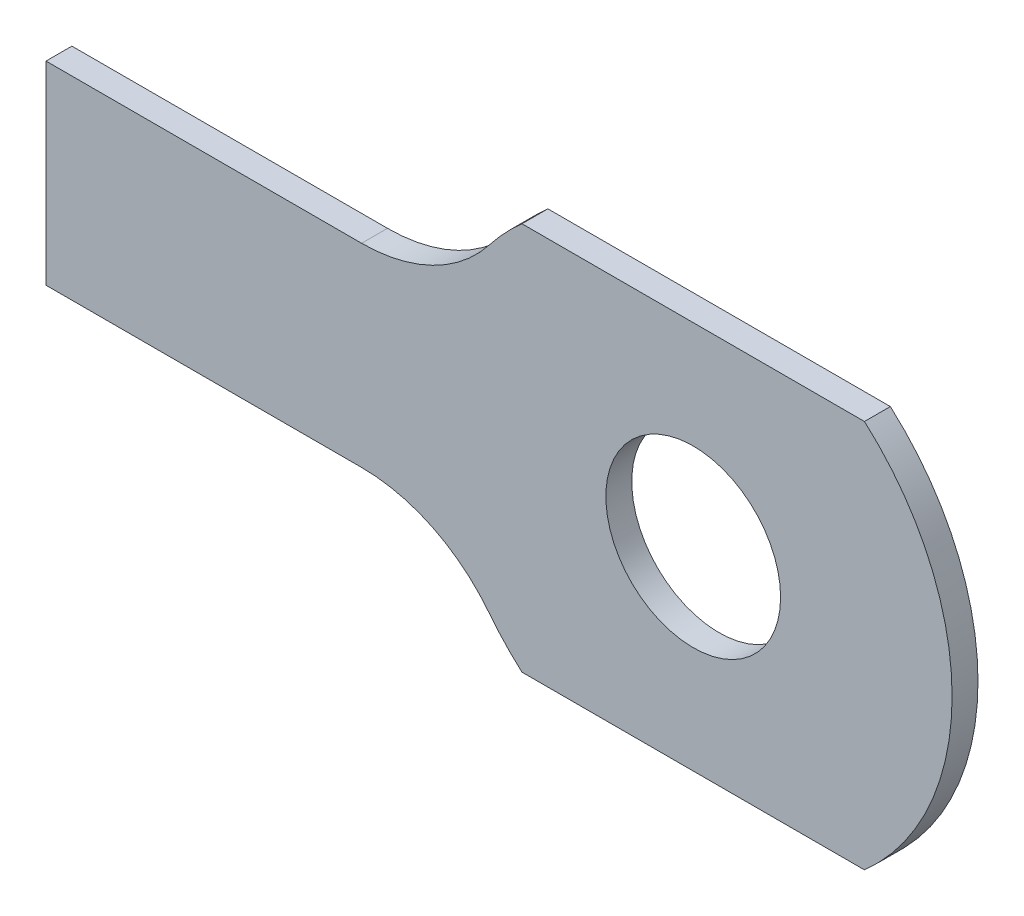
ISO-10303-21;
HEADER;
FILE_DESCRIPTION(('STEP AP214'),'2;1');
FILE_NAME('part.step','',(''),(''),'','','');
FILE_SCHEMA(('AUTOMOTIVE_DESIGN { 1 0 10303 214 1 1 1 1 }'));
ENDSEC;
DATA;
#1=APPLICATION_CONTEXT('core data for automotive mechanical design processes');
#2=APPLICATION_PROTOCOL_DEFINITION('international standard','automotive_design',2000,#1);
#3=PRODUCT_CONTEXT('',#1,'mechanical');
#4=PRODUCT('Part','Part','',(#3));
#5=PRODUCT_RELATED_PRODUCT_CATEGORY('part','',(#4));
#6=PRODUCT_DEFINITION_FORMATION('','',#4);
#7=PRODUCT_DEFINITION_CONTEXT('part definition',#1,'design');
#8=PRODUCT_DEFINITION('design','',#6,#7);
#9=PRODUCT_DEFINITION_SHAPE('','',#8);
#10=(LENGTH_UNIT() NAMED_UNIT(*) SI_UNIT(.MILLI.,.METRE.));
#11=(NAMED_UNIT(*) PLANE_ANGLE_UNIT() SI_UNIT($,.RADIAN.));
#12=(NAMED_UNIT(*) SI_UNIT($,.STERADIAN.) SOLID_ANGLE_UNIT());
#13=UNCERTAINTY_MEASURE_WITH_UNIT(LENGTH_MEASURE(1.E-05),#10,'distance_accuracy_value','');
#14=(GEOMETRIC_REPRESENTATION_CONTEXT(3) GLOBAL_UNCERTAINTY_ASSIGNED_CONTEXT((#13)) GLOBAL_UNIT_ASSIGNED_CONTEXT((#10,
#11,#12)) REPRESENTATION_CONTEXT('',''));
#15=CARTESIAN_POINT('',(0.,0.,0.));
#16=DIRECTION('',(0.,0.,1.));
#17=DIRECTION('',(1.,0.,0.));
#18=AXIS2_PLACEMENT_3D('',#15,#16,#17);
#19=CARTESIAN_POINT('',(0.,0.,-0.4));
#20=DIRECTION('',(0.,0.,1.));
#21=DIRECTION('',(1.,0.,0.));
#22=AXIS2_PLACEMENT_3D('',#19,#20,#21);
#23=CYLINDRICAL_SURFACE('',#22,4.);
#24=CARTESIAN_POINT('',(0.,0.,0.));
#25=DIRECTION('',(0.,0.,1.));
#26=DIRECTION('',(1.,0.,0.));
#27=AXIS2_PLACEMENT_3D('',#24,#25,#26);
#28=CIRCLE('',#27,4.);
#29=CARTESIAN_POINT('',(-3.15290792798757,-2.46153846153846,0.));
#30=VERTEX_POINT('',#29);
#31=CARTESIAN_POINT('',(-2.64575131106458,-3.,0.));
#32=VERTEX_POINT('',#31);
#33=EDGE_CURVE('E141',#30,#32,#28,.T.);
#34=ORIENTED_EDGE('',*,*,#33,.F.);
#35=DIRECTION('',(0.,0.,1.));
#36=VECTOR('',#35,1.);
#37=CARTESIAN_POINT('',(-3.15290792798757,-2.46153846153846,-0.4));
#38=LINE('',#37,#36);
#39=CARTESIAN_POINT('',(-3.15290792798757,-2.46153846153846,-0.4));
#40=VERTEX_POINT('',#39);
#41=EDGE_CURVE('E11',#40,#30,#38,.T.);
#42=ORIENTED_EDGE('',*,*,#41,.F.);
#43=CARTESIAN_POINT('',(0.,0.,-0.4));
#44=DIRECTION('',(0.,0.,1.));
#45=DIRECTION('',(1.,0.,0.));
#46=AXIS2_PLACEMENT_3D('',#43,#44,#45);
#47=CIRCLE('',#46,4.);
#48=CARTESIAN_POINT('',(-2.64575131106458,-3.,-0.4));
#49=VERTEX_POINT('',#48);
#50=EDGE_CURVE('E168',#40,#49,#47,.T.);
#51=ORIENTED_EDGE('',*,*,#50,.T.);
#52=DIRECTION('',(0.,0.,1.));
#53=VECTOR('',#52,1.);
#54=CARTESIAN_POINT('',(-2.64575131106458,-3.,-0.4));
#55=LINE('',#54,#53);
#56=EDGE_CURVE('E35',#49,#32,#55,.T.);
#57=ORIENTED_EDGE('',*,*,#56,.T.);
#58=EDGE_LOOP('',(#34,#42,#51,#57));
#59=FACE_BOUND('',#58,.T.);
#60=ADVANCED_FACE('F32',(#59),#23,.T.);
#61=CARTESIAN_POINT('',(-5.1234753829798,-4.,-0.4));
#62=DIRECTION('',(0.,0.,1.));
#63=DIRECTION('',(1.,0.,0.));
#64=AXIS2_PLACEMENT_3D('',#61,#62,#63);
#65=CYLINDRICAL_SURFACE('',#64,2.5);
#66=CARTESIAN_POINT('',(-5.1234753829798,-4.,0.));
#67=DIRECTION('',(0.,0.,-1.));
#68=DIRECTION('',(-1.,0.,0.));
#69=AXIS2_PLACEMENT_3D('',#66,#67,#68);
#70=CIRCLE('',#69,2.5);
#71=CARTESIAN_POINT('',(-5.1234753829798,-1.5,0.));
#72=VERTEX_POINT('',#71);
#73=EDGE_CURVE('E166',#72,#30,#70,.T.);
#74=ORIENTED_EDGE('',*,*,#73,.F.);
#75=DIRECTION('',(0.,0.,1.));
#76=VECTOR('',#75,1.);
#77=CARTESIAN_POINT('',(-5.1234753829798,-1.5,-0.4));
#78=LINE('',#77,#76);
#79=CARTESIAN_POINT('',(-5.1234753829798,-1.5,-0.4));
#80=VERTEX_POINT('',#79);
#81=EDGE_CURVE('E41',#80,#72,#78,.T.);
#82=ORIENTED_EDGE('',*,*,#81,.F.);
#83=CARTESIAN_POINT('',(-5.1234753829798,-4.,-0.4));
#84=DIRECTION('',(0.,0.,-1.));
#85=DIRECTION('',(-1.,0.,0.));
#86=AXIS2_PLACEMENT_3D('',#83,#84,#85);
#87=CIRCLE('',#86,2.5);
#88=EDGE_CURVE('E131',#80,#40,#87,.T.);
#89=ORIENTED_EDGE('',*,*,#88,.T.);
#90=ORIENTED_EDGE('',*,*,#41,.T.);
#91=EDGE_LOOP('',(#74,#82,#89,#90));
#92=FACE_BOUND('',#91,.T.);
#93=ADVANCED_FACE('F184',(#92),#65,.F.);
#94=CARTESIAN_POINT('',(-10.,-1.5,-0.4));
#95=DIRECTION('',(0.,-1.,0.));
#96=DIRECTION('',(1.,0.,0.));
#97=AXIS2_PLACEMENT_3D('',#94,#95,#96);
#98=PLANE('',#97);
#99=DIRECTION('',(1.,0.,0.));
#100=VECTOR('',#99,1.);
#101=CARTESIAN_POINT('',(-10.,-1.5,0.));
#102=LINE('',#101,#100);
#103=CARTESIAN_POINT('',(-10.,-1.5,0.));
#104=VERTEX_POINT('',#103);
#105=EDGE_CURVE('E118',#104,#72,#102,.T.);
#106=ORIENTED_EDGE('',*,*,#105,.F.);
#107=DIRECTION('',(0.,0.,1.));
#108=VECTOR('',#107,1.);
#109=CARTESIAN_POINT('',(-10.,-1.5,-0.4));
#110=LINE('',#109,#108);
#111=CARTESIAN_POINT('',(-10.,-1.5,-0.4));
#112=VERTEX_POINT('',#111);
#113=EDGE_CURVE('E113',#112,#104,#110,.T.);
#114=ORIENTED_EDGE('',*,*,#113,.F.);
#115=DIRECTION('',(1.,0.,0.));
#116=VECTOR('',#115,1.);
#117=CARTESIAN_POINT('',(-10.,-1.5,-0.4));
#118=LINE('',#117,#116);
#119=EDGE_CURVE('E116',#112,#80,#118,.T.);
#120=ORIENTED_EDGE('',*,*,#119,.T.);
#121=ORIENTED_EDGE('',*,*,#81,.T.);
#122=EDGE_LOOP('',(#106,#114,#120,#121));
#123=FACE_BOUND('',#122,.T.);
#124=ADVANCED_FACE('F115',(#123),#98,.T.);
#125=CARTESIAN_POINT('',(-10.,1.5,-0.4));
#126=DIRECTION('',(-1.,0.,0.));
#127=DIRECTION('',(0.,-1.,0.));
#128=AXIS2_PLACEMENT_3D('',#125,#126,#127);
#129=PLANE('',#128);
#130=DIRECTION('',(0.,-1.,0.));
#131=VECTOR('',#130,1.);
#132=CARTESIAN_POINT('',(-10.,1.5,0.));
#133=LINE('',#132,#131);
#134=CARTESIAN_POINT('',(-10.,1.5,0.));
#135=VERTEX_POINT('',#134);
#136=EDGE_CURVE('E163',#135,#104,#133,.T.);
#137=ORIENTED_EDGE('',*,*,#136,.F.);
#138=DIRECTION('',(0.,0.,1.));
#139=VECTOR('',#138,1.);
#140=CARTESIAN_POINT('',(-10.,1.5,-0.4));
#141=LINE('',#140,#139);
#142=CARTESIAN_POINT('',(-10.,1.5,-0.4));
#143=VERTEX_POINT('',#142);
#144=EDGE_CURVE('E123',#143,#135,#141,.T.);
#145=ORIENTED_EDGE('',*,*,#144,.F.);
#146=DIRECTION('',(0.,-1.,0.));
#147=VECTOR('',#146,1.);
#148=CARTESIAN_POINT('',(-10.,1.5,-0.4));
#149=LINE('',#148,#147);
#150=EDGE_CURVE('E129',#143,#112,#149,.T.);
#151=ORIENTED_EDGE('',*,*,#150,.T.);
#152=ORIENTED_EDGE('',*,*,#113,.T.);
#153=EDGE_LOOP('',(#137,#145,#151,#152));
#154=FACE_BOUND('',#153,.T.);
#155=ADVANCED_FACE('F133',(#154),#129,.T.);
#156=CARTESIAN_POINT('',(-10.,1.5,-0.4));
#157=DIRECTION('',(0.,1.,0.));
#158=DIRECTION('',(-1.,0.,0.));
#159=AXIS2_PLACEMENT_3D('',#156,#157,#158);
#160=PLANE('',#159);
#161=DIRECTION('',(-1.,0.,0.));
#162=VECTOR('',#161,1.);
#163=CARTESIAN_POINT('',(-10.,1.5,0.));
#164=LINE('',#163,#162);
#165=CARTESIAN_POINT('',(-5.1234753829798,1.5,0.));
#166=VERTEX_POINT('',#165);
#167=EDGE_CURVE('E160',#166,#135,#164,.T.);
#168=ORIENTED_EDGE('',*,*,#167,.F.);
#169=DIRECTION('',(0.,0.,1.));
#170=VECTOR('',#169,1.);
#171=CARTESIAN_POINT('',(-5.1234753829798,1.5,-0.4));
#172=LINE('',#171,#170);
#173=CARTESIAN_POINT('',(-5.1234753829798,1.5,-0.4));
#174=VERTEX_POINT('',#173);
#175=EDGE_CURVE('E172',#174,#166,#172,.T.);
#176=ORIENTED_EDGE('',*,*,#175,.F.);
#177=DIRECTION('',(-1.,0.,0.));
#178=VECTOR('',#177,1.);
#179=CARTESIAN_POINT('',(-10.,1.5,-0.4));
#180=LINE('',#179,#178);
#181=EDGE_CURVE('E134',#174,#143,#180,.T.);
#182=ORIENTED_EDGE('',*,*,#181,.T.);
#183=ORIENTED_EDGE('',*,*,#144,.T.);
#184=EDGE_LOOP('',(#168,#176,#182,#183));
#185=FACE_BOUND('',#184,.T.);
#186=ADVANCED_FACE('F197',(#185),#160,.T.);
#187=CARTESIAN_POINT('',(-5.1234753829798,4.,-0.4));
#188=DIRECTION('',(0.,0.,1.));
#189=DIRECTION('',(1.,0.,0.));
#190=AXIS2_PLACEMENT_3D('',#187,#188,#189);
#191=CYLINDRICAL_SURFACE('',#190,2.5);
#192=CARTESIAN_POINT('',(-5.1234753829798,4.,0.));
#193=DIRECTION('',(0.,0.,-1.));
#194=DIRECTION('',(1.,0.,0.));
#195=AXIS2_PLACEMENT_3D('',#192,#193,#194);
#196=CIRCLE('',#195,2.5);
#197=CARTESIAN_POINT('',(-3.15290792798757,2.46153846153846,0.));
#198=VERTEX_POINT('',#197);
#199=EDGE_CURVE('E157',#198,#166,#196,.T.);
#200=ORIENTED_EDGE('',*,*,#199,.F.);
#201=DIRECTION('',(0.,0.,1.));
#202=VECTOR('',#201,1.);
#203=CARTESIAN_POINT('',(-3.15290792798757,2.46153846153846,-0.4));
#204=LINE('',#203,#202);
#205=CARTESIAN_POINT('',(-3.15290792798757,2.46153846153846,-0.4));
#206=VERTEX_POINT('',#205);
#207=EDGE_CURVE('E174',#206,#198,#204,.T.);
#208=ORIENTED_EDGE('',*,*,#207,.F.);
#209=CARTESIAN_POINT('',(-5.1234753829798,4.,-0.4));
#210=DIRECTION('',(0.,0.,-1.));
#211=DIRECTION('',(1.,0.,0.));
#212=AXIS2_PLACEMENT_3D('',#209,#210,#211);
#213=CIRCLE('',#212,2.5);
#214=EDGE_CURVE('E136',#206,#174,#213,.T.);
#215=ORIENTED_EDGE('',*,*,#214,.T.);
#216=ORIENTED_EDGE('',*,*,#175,.T.);
#217=EDGE_LOOP('',(#200,#208,#215,#216));
#218=FACE_BOUND('',#217,.T.);
#219=ADVANCED_FACE('F200',(#218),#191,.F.);
#220=CARTESIAN_POINT('',(0.,0.,-0.4));
#221=DIRECTION('',(0.,0.,1.));
#222=DIRECTION('',(1.,0.,0.));
#223=AXIS2_PLACEMENT_3D('',#220,#221,#222);
#224=CYLINDRICAL_SURFACE('',#223,4.);
#225=CARTESIAN_POINT('',(0.,0.,0.));
#226=DIRECTION('',(0.,0.,1.));
#227=DIRECTION('',(1.,0.,0.));
#228=AXIS2_PLACEMENT_3D('',#225,#226,#227);
#229=CIRCLE('',#228,4.);
#230=CARTESIAN_POINT('',(-2.64575131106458,3.,0.));
#231=VERTEX_POINT('',#230);
#232=EDGE_CURVE('E154',#231,#198,#229,.T.);
#233=ORIENTED_EDGE('',*,*,#232,.F.);
#234=DIRECTION('',(0.,0.,1.));
#235=VECTOR('',#234,1.);
#236=CARTESIAN_POINT('',(-2.64575131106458,3.,-0.4));
#237=LINE('',#236,#235);
#238=CARTESIAN_POINT('',(-2.64575131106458,3.,-0.4));
#239=VERTEX_POINT('',#238);
#240=EDGE_CURVE('E176',#239,#231,#237,.T.);
#241=ORIENTED_EDGE('',*,*,#240,.F.);
#242=CARTESIAN_POINT('',(0.,0.,-0.4));
#243=DIRECTION('',(0.,0.,1.));
#244=DIRECTION('',(1.,0.,0.));
#245=AXIS2_PLACEMENT_3D('',#242,#243,#244);
#246=CIRCLE('',#245,4.);
#247=EDGE_CURVE('E249',#239,#206,#246,.T.);
#248=ORIENTED_EDGE('',*,*,#247,.T.);
#249=ORIENTED_EDGE('',*,*,#207,.T.);
#250=EDGE_LOOP('',(#233,#241,#248,#249));
#251=FACE_BOUND('',#250,.T.);
#252=ADVANCED_FACE('F204',(#251),#224,.T.);
#253=CARTESIAN_POINT('',(-2.64575131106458,3.,-0.4));
#254=DIRECTION('',(0.,1.,0.));
#255=DIRECTION('',(0.,0.,1.));
#256=AXIS2_PLACEMENT_3D('',#253,#254,#255);
#257=PLANE('',#256);
#258=DIRECTION('',(-1.,0.,0.));
#259=VECTOR('',#258,1.);
#260=CARTESIAN_POINT('',(-2.64575131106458,3.,0.));
#261=LINE('',#260,#259);
#262=CARTESIAN_POINT('',(2.64575131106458,3.,0.));
#263=VERTEX_POINT('',#262);
#264=EDGE_CURVE('E151',#263,#231,#261,.T.);
#265=ORIENTED_EDGE('',*,*,#264,.F.);
#266=DIRECTION('',(0.,0.,1.));
#267=VECTOR('',#266,1.);
#268=CARTESIAN_POINT('',(2.64575131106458,3.,-0.4));
#269=LINE('',#268,#267);
#270=CARTESIAN_POINT('',(2.64575131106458,3.,-0.4));
#271=VERTEX_POINT('',#270);
#272=EDGE_CURVE('E178',#271,#263,#269,.T.);
#273=ORIENTED_EDGE('',*,*,#272,.F.);
#274=DIRECTION('',(-1.,0.,0.));
#275=VECTOR('',#274,1.);
#276=CARTESIAN_POINT('',(-2.64575131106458,3.,-0.4));
#277=LINE('',#276,#275);
#278=EDGE_CURVE('E246',#271,#239,#277,.T.);
#279=ORIENTED_EDGE('',*,*,#278,.T.);
#280=ORIENTED_EDGE('',*,*,#240,.T.);
#281=EDGE_LOOP('',(#265,#273,#279,#280));
#282=FACE_BOUND('',#281,.T.);
#283=ADVANCED_FACE('F208',(#282),#257,.T.);
#284=CARTESIAN_POINT('',(0.,0.,-0.4));
#285=DIRECTION('',(0.,0.,1.));
#286=DIRECTION('',(1.,0.,0.));
#287=AXIS2_PLACEMENT_3D('',#284,#285,#286);
#288=CYLINDRICAL_SURFACE('',#287,4.);
#289=CARTESIAN_POINT('',(0.,0.,0.));
#290=DIRECTION('',(0.,0.,1.));
#291=DIRECTION('',(1.,0.,0.));
#292=AXIS2_PLACEMENT_3D('',#289,#290,#291);
#293=CIRCLE('',#292,4.);
#294=CARTESIAN_POINT('',(2.64575131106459,-3.,0.));
#295=VERTEX_POINT('',#294);
#296=EDGE_CURVE('E148',#295,#263,#293,.T.);
#297=ORIENTED_EDGE('',*,*,#296,.F.);
#298=DIRECTION('',(0.,0.,1.));
#299=VECTOR('',#298,1.);
#300=CARTESIAN_POINT('',(2.64575131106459,-3.,-0.4));
#301=LINE('',#300,#299);
#302=CARTESIAN_POINT('',(2.64575131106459,-3.,-0.4));
#303=VERTEX_POINT('',#302);
#304=EDGE_CURVE('E179',#303,#295,#301,.T.);
#305=ORIENTED_EDGE('',*,*,#304,.F.);
#306=CARTESIAN_POINT('',(0.,0.,-0.4));
#307=DIRECTION('',(0.,0.,1.));
#308=DIRECTION('',(1.,0.,0.));
#309=AXIS2_PLACEMENT_3D('',#306,#307,#308);
#310=CIRCLE('',#309,4.);
#311=EDGE_CURVE('E243',#303,#271,#310,.T.);
#312=ORIENTED_EDGE('',*,*,#311,.T.);
#313=ORIENTED_EDGE('',*,*,#272,.T.);
#314=EDGE_LOOP('',(#297,#305,#312,#313));
#315=FACE_BOUND('',#314,.T.);
#316=ADVANCED_FACE('F212',(#315),#288,.T.);
#317=CARTESIAN_POINT('',(-2.64575131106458,-3.,-0.4));
#318=DIRECTION('',(0.,-1.,0.));
#319=DIRECTION('',(0.,0.,-1.));
#320=AXIS2_PLACEMENT_3D('',#317,#318,#319);
#321=PLANE('',#320);
#322=DIRECTION('',(1.,0.,0.));
#323=VECTOR('',#322,1.);
#324=CARTESIAN_POINT('',(-2.64575131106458,-3.,0.));
#325=LINE('',#324,#323);
#326=EDGE_CURVE('E144',#32,#295,#325,.T.);
#327=ORIENTED_EDGE('',*,*,#326,.F.);
#328=ORIENTED_EDGE('',*,*,#56,.F.);
#329=DIRECTION('',(1.,0.,0.));
#330=VECTOR('',#329,1.);
#331=CARTESIAN_POINT('',(-2.64575131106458,-3.,-0.4));
#332=LINE('',#331,#330);
#333=EDGE_CURVE('E241',#49,#303,#332,.T.);
#334=ORIENTED_EDGE('',*,*,#333,.T.);
#335=ORIENTED_EDGE('',*,*,#304,.T.);
#336=EDGE_LOOP('',(#327,#328,#334,#335));
#337=FACE_BOUND('',#336,.T.);
#338=ADVANCED_FACE('F181',(#337),#321,.T.);
#339=CARTESIAN_POINT('',(0.,0.,-0.4));
#340=DIRECTION('',(0.,0.,1.));
#341=DIRECTION('',(1.,0.,0.));
#342=AXIS2_PLACEMENT_3D('',#339,#340,#341);
#343=PLANE('',#342);
#344=CARTESIAN_POINT('',(0.,0.,-0.4));
#345=DIRECTION('',(0.,0.,1.));
#346=DIRECTION('',(1.,0.,0.));
#347=AXIS2_PLACEMENT_3D('',#344,#345,#346);
#348=CIRCLE('',#347,1.35);
#349=CARTESIAN_POINT('',(1.35,0.,-0.4));
#350=VERTEX_POINT('',#349);
#351=EDGE_CURVE('E145',#350,#350,#348,.T.);
#352=ORIENTED_EDGE('',*,*,#351,.T.);
#353=EDGE_LOOP('',(#352));
#354=FACE_BOUND('',#353,.T.);
#355=ORIENTED_EDGE('',*,*,#50,.F.);
#356=ORIENTED_EDGE('',*,*,#88,.F.);
#357=ORIENTED_EDGE('',*,*,#119,.F.);
#358=ORIENTED_EDGE('',*,*,#150,.F.);
#359=ORIENTED_EDGE('',*,*,#181,.F.);
#360=ORIENTED_EDGE('',*,*,#214,.F.);
#361=ORIENTED_EDGE('',*,*,#247,.F.);
#362=ORIENTED_EDGE('',*,*,#278,.F.);
#363=ORIENTED_EDGE('',*,*,#311,.F.);
#364=ORIENTED_EDGE('',*,*,#333,.F.);
#365=EDGE_LOOP('',(#355,#356,#357,#358,#359,#360,#361,#362,#363,#364));
#366=FACE_BOUND('',#365,.T.);
#367=ADVANCED_FACE('F127',(#354,#366),#343,.F.);
#368=CARTESIAN_POINT('',(0.,0.,0.));
#369=DIRECTION('',(0.,0.,1.));
#370=DIRECTION('',(1.,0.,0.));
#371=AXIS2_PLACEMENT_3D('',#368,#369,#370);
#372=PLANE('',#371);
#373=CARTESIAN_POINT('',(0.,0.,0.));
#374=DIRECTION('',(0.,0.,1.));
#375=DIRECTION('',(1.,0.,0.));
#376=AXIS2_PLACEMENT_3D('',#373,#374,#375);
#377=CIRCLE('',#376,1.35);
#378=CARTESIAN_POINT('',(1.35,0.,0.));
#379=VERTEX_POINT('',#378);
#380=EDGE_CURVE('E236',#379,#379,#377,.T.);
#381=ORIENTED_EDGE('',*,*,#380,.F.);
#382=EDGE_LOOP('',(#381));
#383=FACE_BOUND('',#382,.T.);
#384=ORIENTED_EDGE('',*,*,#33,.T.);
#385=ORIENTED_EDGE('',*,*,#326,.T.);
#386=ORIENTED_EDGE('',*,*,#296,.T.);
#387=ORIENTED_EDGE('',*,*,#264,.T.);
#388=ORIENTED_EDGE('',*,*,#232,.T.);
#389=ORIENTED_EDGE('',*,*,#199,.T.);
#390=ORIENTED_EDGE('',*,*,#167,.T.);
#391=ORIENTED_EDGE('',*,*,#136,.T.);
#392=ORIENTED_EDGE('',*,*,#105,.T.);
#393=ORIENTED_EDGE('',*,*,#73,.T.);
#394=EDGE_LOOP('',(#384,#385,#386,#387,#388,#389,#390,#391,#392,#393));
#395=FACE_BOUND('',#394,.T.);
#396=ADVANCED_FACE('F183',(#383,#395),#372,.T.);
#397=CARTESIAN_POINT('',(0.,0.,-0.4));
#398=DIRECTION('',(0.,0.,1.));
#399=DIRECTION('',(1.,0.,0.));
#400=AXIS2_PLACEMENT_3D('',#397,#398,#399);
#401=CYLINDRICAL_SURFACE('',#400,1.35);
#402=ORIENTED_EDGE('',*,*,#351,.F.);
#403=EDGE_LOOP('',(#402));
#404=FACE_BOUND('',#403,.T.);
#405=ORIENTED_EDGE('',*,*,#380,.T.);
#406=EDGE_LOOP('',(#405));
#407=FACE_BOUND('',#406,.T.);
#408=ADVANCED_FACE('F224',(#404,#407),#401,.F.);
#409=CLOSED_SHELL('',(#60,#93,#124,#155,#186,#219,#252,#283,#316,#338,#367,#396,#408));
#410=MANIFOLD_SOLID_BREP('B2',#409);
#411=ADVANCED_BREP_SHAPE_REPRESENTATION('',(#18,#410),#14);
#412=SHAPE_DEFINITION_REPRESENTATION(#9,#411);
ENDSEC;
END-ISO-10303-21;
